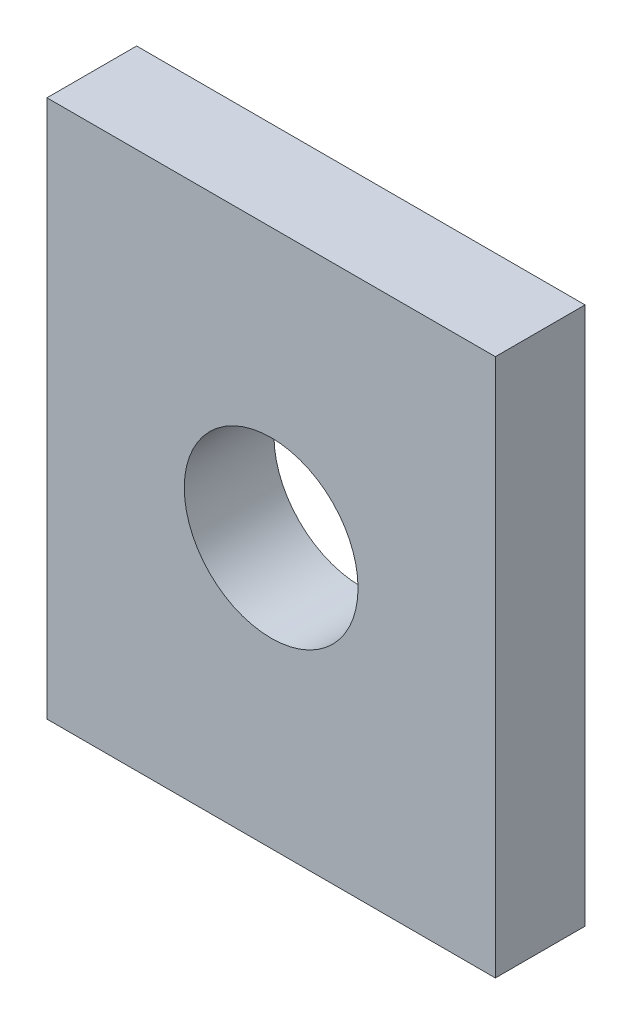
ISO-10303-21;
HEADER;
FILE_DESCRIPTION(('STEP AP214'),'2;1');
FILE_NAME('part.step','',(''),(''),'','','');
FILE_SCHEMA(('AUTOMOTIVE_DESIGN { 1 0 10303 214 1 1 1 1 }'));
ENDSEC;
DATA;
#1=APPLICATION_CONTEXT('core data for automotive mechanical design processes');
#2=APPLICATION_PROTOCOL_DEFINITION('international standard','automotive_design',2000,#1);
#3=PRODUCT_CONTEXT('',#1,'mechanical');
#4=PRODUCT('Part','Part','',(#3));
#5=PRODUCT_RELATED_PRODUCT_CATEGORY('part','',(#4));
#6=PRODUCT_DEFINITION_FORMATION('','',#4);
#7=PRODUCT_DEFINITION_CONTEXT('part definition',#1,'design');
#8=PRODUCT_DEFINITION('design','',#6,#7);
#9=PRODUCT_DEFINITION_SHAPE('','',#8);
#10=(LENGTH_UNIT() NAMED_UNIT(*) SI_UNIT(.MILLI.,.METRE.));
#11=(NAMED_UNIT(*) PLANE_ANGLE_UNIT() SI_UNIT($,.RADIAN.));
#12=(NAMED_UNIT(*) SI_UNIT($,.STERADIAN.) SOLID_ANGLE_UNIT());
#13=UNCERTAINTY_MEASURE_WITH_UNIT(LENGTH_MEASURE(1.E-05),#10,'distance_accuracy_value','');
#14=(GEOMETRIC_REPRESENTATION_CONTEXT(3) GLOBAL_UNCERTAINTY_ASSIGNED_CONTEXT((#13)) GLOBAL_UNIT_ASSIGNED_CONTEXT((#10,
#11,#12)) REPRESENTATION_CONTEXT('',''));
#15=CARTESIAN_POINT('',(0.,0.,0.));
#16=DIRECTION('',(0.,0.,1.));
#17=DIRECTION('',(1.,0.,0.));
#18=AXIS2_PLACEMENT_3D('',#15,#16,#17);
#19=CARTESIAN_POINT('',(0.,0.,16.));
#20=DIRECTION('',(0.,0.,1.));
#21=DIRECTION('',(1.,0.,0.));
#22=AXIS2_PLACEMENT_3D('',#19,#20,#21);
#23=PLANE('',#22);
#24=CARTESIAN_POINT('',(0.,0.,16.));
#25=DIRECTION('',(0.,0.,1.));
#26=DIRECTION('',(1.,0.,0.));
#27=AXIS2_PLACEMENT_3D('',#24,#25,#26);
#28=CIRCLE('',#27,15.5);
#29=CARTESIAN_POINT('',(15.5,0.,16.));
#30=VERTEX_POINT('',#29);
#31=EDGE_CURVE('E20',#30,#30,#28,.T.);
#32=ORIENTED_EDGE('',*,*,#31,.F.);
#33=EDGE_LOOP('',(#32));
#34=FACE_BOUND('',#33,.T.);
#35=DIRECTION('',(1.,0.,0.));
#36=VECTOR('',#35,1.);
#37=CARTESIAN_POINT('',(-40.,-48.,16.));
#38=LINE('',#37,#36);
#39=CARTESIAN_POINT('',(-40.,-48.,16.));
#40=VERTEX_POINT('',#39);
#41=CARTESIAN_POINT('',(40.,-48.,16.));
#42=VERTEX_POINT('',#41);
#43=EDGE_CURVE('E98',#40,#42,#38,.T.);
#44=ORIENTED_EDGE('',*,*,#43,.T.);
#45=DIRECTION('',(0.,1.,0.));
#46=VECTOR('',#45,1.);
#47=CARTESIAN_POINT('',(40.,-48.,16.));
#48=LINE('',#47,#46);
#49=CARTESIAN_POINT('',(40.,48.,16.));
#50=VERTEX_POINT('',#49);
#51=EDGE_CURVE('E115',#42,#50,#48,.T.);
#52=ORIENTED_EDGE('',*,*,#51,.T.);
#53=DIRECTION('',(-1.,0.,0.));
#54=VECTOR('',#53,1.);
#55=CARTESIAN_POINT('',(40.,48.,16.));
#56=LINE('',#55,#54);
#57=CARTESIAN_POINT('',(-40.,48.,16.));
#58=VERTEX_POINT('',#57);
#59=EDGE_CURVE('E90',#50,#58,#56,.T.);
#60=ORIENTED_EDGE('',*,*,#59,.T.);
#61=DIRECTION('',(0.,-1.,0.));
#62=VECTOR('',#61,1.);
#63=CARTESIAN_POINT('',(-40.,48.,16.));
#64=LINE('',#63,#62);
#65=EDGE_CURVE('E89',#58,#40,#64,.T.);
#66=ORIENTED_EDGE('',*,*,#65,.T.);
#67=EDGE_LOOP('',(#44,#52,#60,#66));
#68=FACE_BOUND('',#67,.T.);
#69=ADVANCED_FACE('F16',(#34,#68),#23,.T.);
#70=CARTESIAN_POINT('',(0.,0.,0.));
#71=DIRECTION('',(0.,0.,1.));
#72=DIRECTION('',(1.,0.,0.));
#73=AXIS2_PLACEMENT_3D('',#70,#71,#72);
#74=PLANE('',#73);
#75=CARTESIAN_POINT('',(0.,0.,0.));
#76=DIRECTION('',(0.,0.,1.));
#77=DIRECTION('',(1.,0.,0.));
#78=AXIS2_PLACEMENT_3D('',#75,#76,#77);
#79=CIRCLE('',#78,15.5);
#80=CARTESIAN_POINT('',(15.5,0.,0.));
#81=VERTEX_POINT('',#80);
#82=EDGE_CURVE('E10',#81,#81,#79,.T.);
#83=ORIENTED_EDGE('',*,*,#82,.T.);
#84=EDGE_LOOP('',(#83));
#85=FACE_BOUND('',#84,.T.);
#86=DIRECTION('',(0.,-1.,0.));
#87=VECTOR('',#86,1.);
#88=CARTESIAN_POINT('',(-40.,48.,0.));
#89=LINE('',#88,#87);
#90=CARTESIAN_POINT('',(-40.,48.,0.));
#91=VERTEX_POINT('',#90);
#92=CARTESIAN_POINT('',(-40.,-48.,0.));
#93=VERTEX_POINT('',#92);
#94=EDGE_CURVE('E78',#91,#93,#89,.T.);
#95=ORIENTED_EDGE('',*,*,#94,.F.);
#96=DIRECTION('',(-1.,0.,0.));
#97=VECTOR('',#96,1.);
#98=CARTESIAN_POINT('',(40.,48.,0.));
#99=LINE('',#98,#97);
#100=CARTESIAN_POINT('',(40.,48.,0.));
#101=VERTEX_POINT('',#100);
#102=EDGE_CURVE('E127',#101,#91,#99,.T.);
#103=ORIENTED_EDGE('',*,*,#102,.F.);
#104=DIRECTION('',(0.,1.,0.));
#105=VECTOR('',#104,1.);
#106=CARTESIAN_POINT('',(40.,-48.,0.));
#107=LINE('',#106,#105);
#108=CARTESIAN_POINT('',(40.,-48.,0.));
#109=VERTEX_POINT('',#108);
#110=EDGE_CURVE('E100',#109,#101,#107,.T.);
#111=ORIENTED_EDGE('',*,*,#110,.F.);
#112=DIRECTION('',(1.,0.,0.));
#113=VECTOR('',#112,1.);
#114=CARTESIAN_POINT('',(-40.,-48.,0.));
#115=LINE('',#114,#113);
#116=EDGE_CURVE('E96',#93,#109,#115,.T.);
#117=ORIENTED_EDGE('',*,*,#116,.F.);
#118=EDGE_LOOP('',(#95,#103,#111,#117));
#119=FACE_BOUND('',#118,.T.);
#120=ADVANCED_FACE('F102',(#85,#119),#74,.F.);
#121=CARTESIAN_POINT('',(0.,0.,0.));
#122=DIRECTION('',(0.,0.,-1.));
#123=DIRECTION('',(1.,0.,0.));
#124=AXIS2_PLACEMENT_3D('',#121,#122,#123);
#125=CYLINDRICAL_SURFACE('',#124,15.5);
#126=DIRECTION('',(0.,0.,1.));
#127=VECTOR('',#126,1.);
#128=CARTESIAN_POINT('',(15.5,0.,0.));
#129=LINE('',#128,#127);
#130=EDGE_CURVE('E133',#81,#30,#129,.T.);
#131=ORIENTED_EDGE('',*,*,#130,.T.);
#132=ORIENTED_EDGE('',*,*,#31,.T.);
#133=ORIENTED_EDGE('',*,*,#130,.F.);
#134=ORIENTED_EDGE('',*,*,#82,.F.);
#135=EDGE_LOOP('',(#131,#132,#133,#134));
#136=FACE_BOUND('',#135,.T.);
#137=ADVANCED_FACE('F18',(#136),#125,.F.);
#138=CARTESIAN_POINT('',(-40.,48.,0.));
#139=DIRECTION('',(1.,0.,0.));
#140=DIRECTION('',(0.,1.,0.));
#141=AXIS2_PLACEMENT_3D('',#138,#139,#140);
#142=PLANE('',#141);
#143=ORIENTED_EDGE('',*,*,#94,.T.);
#144=DIRECTION('',(0.,0.,1.));
#145=VECTOR('',#144,1.);
#146=CARTESIAN_POINT('',(-40.,-48.,0.));
#147=LINE('',#146,#145);
#148=EDGE_CURVE('E81',#93,#40,#147,.T.);
#149=ORIENTED_EDGE('',*,*,#148,.T.);
#150=ORIENTED_EDGE('',*,*,#65,.F.);
#151=DIRECTION('',(0.,0.,1.));
#152=VECTOR('',#151,1.);
#153=CARTESIAN_POINT('',(-40.,48.,0.));
#154=LINE('',#153,#152);
#155=EDGE_CURVE('E84',#91,#58,#154,.T.);
#156=ORIENTED_EDGE('',*,*,#155,.F.);
#157=EDGE_LOOP('',(#143,#149,#150,#156));
#158=FACE_BOUND('',#157,.T.);
#159=ADVANCED_FACE('F80',(#158),#142,.F.);
#160=CARTESIAN_POINT('',(40.,48.,0.));
#161=DIRECTION('',(0.,-1.,0.));
#162=DIRECTION('',(0.,0.,-1.));
#163=AXIS2_PLACEMENT_3D('',#160,#161,#162);
#164=PLANE('',#163);
#165=ORIENTED_EDGE('',*,*,#102,.T.);
#166=ORIENTED_EDGE('',*,*,#155,.T.);
#167=ORIENTED_EDGE('',*,*,#59,.F.);
#168=DIRECTION('',(0.,0.,1.));
#169=VECTOR('',#168,1.);
#170=CARTESIAN_POINT('',(40.,48.,0.));
#171=LINE('',#170,#169);
#172=EDGE_CURVE('E113',#101,#50,#171,.T.);
#173=ORIENTED_EDGE('',*,*,#172,.F.);
#174=EDGE_LOOP('',(#165,#166,#167,#173));
#175=FACE_BOUND('',#174,.T.);
#176=ADVANCED_FACE('F154',(#175),#164,.F.);
#177=CARTESIAN_POINT('',(40.,-48.,0.));
#178=DIRECTION('',(-1.,0.,0.));
#179=DIRECTION('',(0.,0.,1.));
#180=AXIS2_PLACEMENT_3D('',#177,#178,#179);
#181=PLANE('',#180);
#182=ORIENTED_EDGE('',*,*,#110,.T.);
#183=ORIENTED_EDGE('',*,*,#172,.T.);
#184=ORIENTED_EDGE('',*,*,#51,.F.);
#185=DIRECTION('',(0.,0.,1.));
#186=VECTOR('',#185,1.);
#187=CARTESIAN_POINT('',(40.,-48.,0.));
#188=LINE('',#187,#186);
#189=EDGE_CURVE('E106',#109,#42,#188,.T.);
#190=ORIENTED_EDGE('',*,*,#189,.F.);
#191=EDGE_LOOP('',(#182,#183,#184,#190));
#192=FACE_BOUND('',#191,.T.);
#193=ADVANCED_FACE('F145',(#192),#181,.F.);
#194=CARTESIAN_POINT('',(-40.,-48.,0.));
#195=DIRECTION('',(0.,1.,0.));
#196=DIRECTION('',(1.,0.,0.));
#197=AXIS2_PLACEMENT_3D('',#194,#195,#196);
#198=PLANE('',#197);
#199=ORIENTED_EDGE('',*,*,#116,.T.);
#200=ORIENTED_EDGE('',*,*,#189,.T.);
#201=ORIENTED_EDGE('',*,*,#43,.F.);
#202=ORIENTED_EDGE('',*,*,#148,.F.);
#203=EDGE_LOOP('',(#199,#200,#201,#202));
#204=FACE_BOUND('',#203,.T.);
#205=ADVANCED_FACE('F94',(#204),#198,.F.);
#206=CLOSED_SHELL('',(#69,#120,#137,#159,#176,#193,#205));
#207=MANIFOLD_SOLID_BREP('B1',#206);
#208=ADVANCED_BREP_SHAPE_REPRESENTATION('',(#18,#207),#14);
#209=SHAPE_DEFINITION_REPRESENTATION(#9,#208);
ENDSEC;
END-ISO-10303-21;
